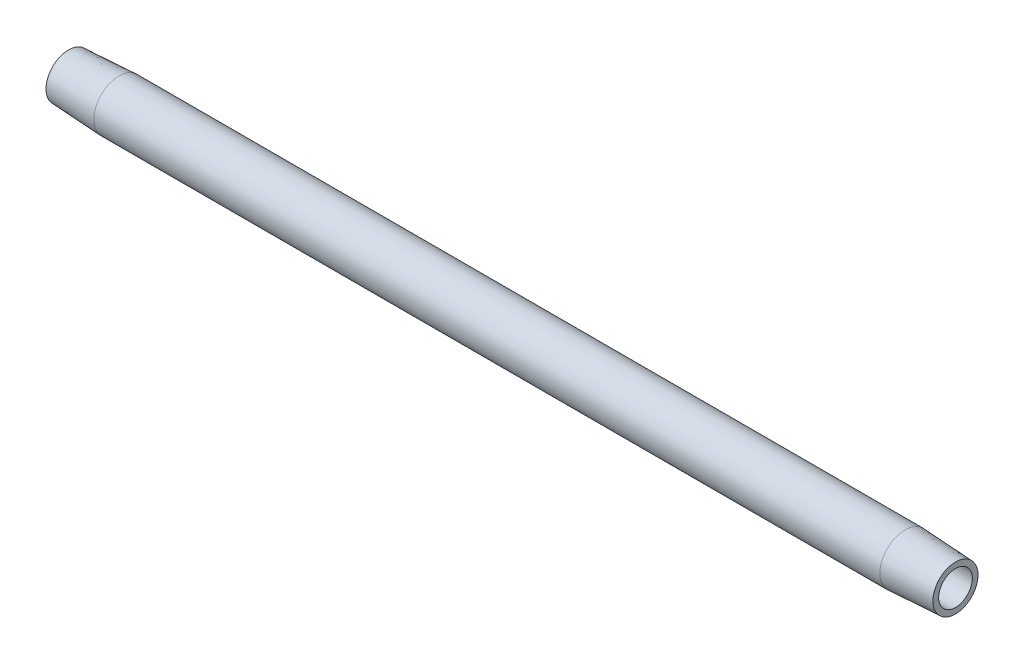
from build123d import *


with BuildPart() as part:
    # Sketch2 → Revolve1 (revolve)
    with BuildSketch(Plane.XY, mode=Mode.PRIVATE) as revolve1_sk:
        Polygon((7.9375, 3.96875), (0, 3.552763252), (0, 2.6543), (139.7, 2.6543), (139.7, 3.552763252), (131.7625, 3.96875), align=None)
    revolve(revolve1_sk.sketch.rotate(Axis((0.476141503, 0, 0), (1, 0, 0)), 90), axis=Axis((0.476141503, 0, 0), (1, 0, 0)))


solid = part.part
